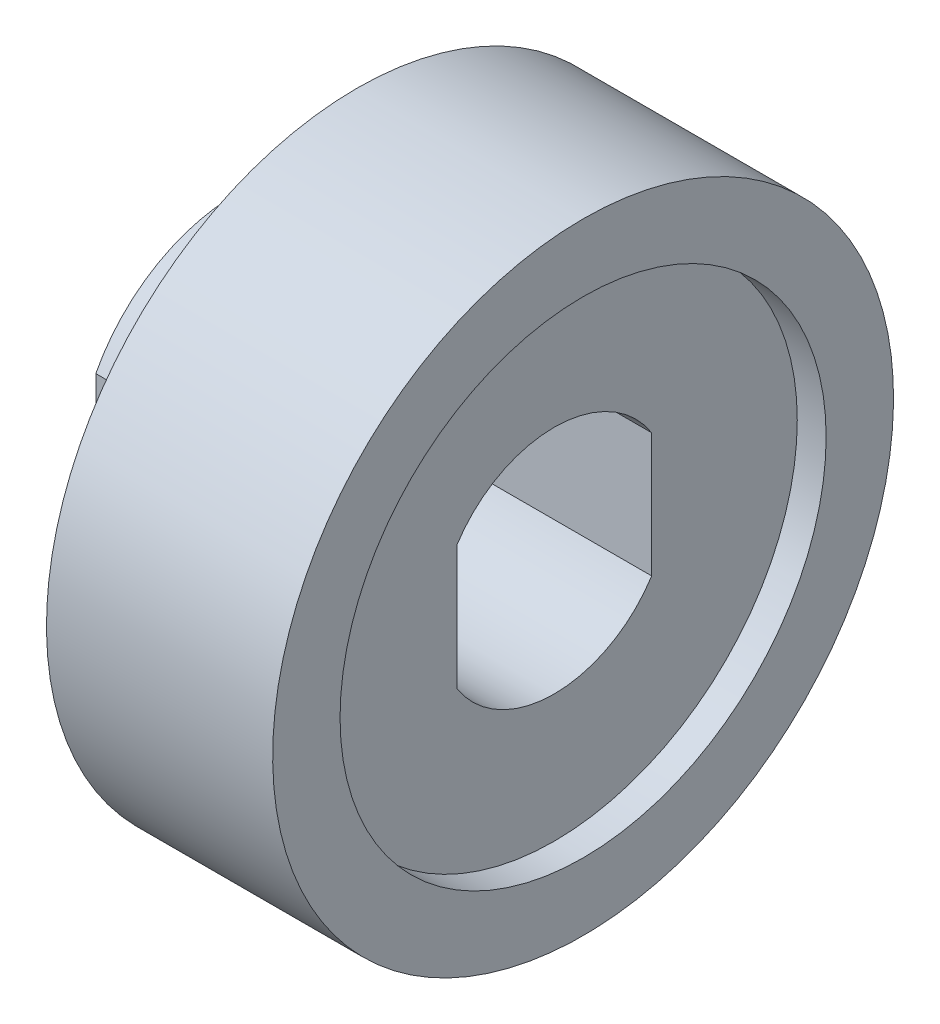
ISO-10303-21;
HEADER;
FILE_DESCRIPTION(('STEP AP214'),'2;1');
FILE_NAME('part.step','',(''),(''),'','','');
FILE_SCHEMA(('AUTOMOTIVE_DESIGN { 1 0 10303 214 1 1 1 1 }'));
ENDSEC;
DATA;
#1=APPLICATION_CONTEXT('core data for automotive mechanical design processes');
#2=APPLICATION_PROTOCOL_DEFINITION('international standard','automotive_design',2000,#1);
#3=PRODUCT_CONTEXT('',#1,'mechanical');
#4=PRODUCT('Part','Part','',(#3));
#5=PRODUCT_RELATED_PRODUCT_CATEGORY('part','',(#4));
#6=PRODUCT_DEFINITION_FORMATION('','',#4);
#7=PRODUCT_DEFINITION_CONTEXT('part definition',#1,'design');
#8=PRODUCT_DEFINITION('design','',#6,#7);
#9=PRODUCT_DEFINITION_SHAPE('','',#8);
#10=(LENGTH_UNIT() NAMED_UNIT(*) SI_UNIT(.MILLI.,.METRE.));
#11=(NAMED_UNIT(*) PLANE_ANGLE_UNIT() SI_UNIT($,.RADIAN.));
#12=(NAMED_UNIT(*) SI_UNIT($,.STERADIAN.) SOLID_ANGLE_UNIT());
#13=UNCERTAINTY_MEASURE_WITH_UNIT(LENGTH_MEASURE(1.E-05),#10,'distance_accuracy_value','');
#14=(GEOMETRIC_REPRESENTATION_CONTEXT(3) GLOBAL_UNCERTAINTY_ASSIGNED_CONTEXT((#13)) GLOBAL_UNIT_ASSIGNED_CONTEXT((#10,
#11,#12)) REPRESENTATION_CONTEXT('',''));
#15=CARTESIAN_POINT('',(0.,0.,0.));
#16=DIRECTION('',(0.,0.,1.));
#17=DIRECTION('',(1.,0.,0.));
#18=AXIS2_PLACEMENT_3D('',#15,#16,#17);
#19=CARTESIAN_POINT('',(0.,0.,0.));
#20=DIRECTION('',(-1.,0.,0.));
#21=DIRECTION('',(0.,0.,1.));
#22=AXIS2_PLACEMENT_3D('',#19,#20,#21);
#23=PLANE('',#22);
#24=DIRECTION('',(0.,1.,0.));
#25=VECTOR('',#24,1.);
#26=CARTESIAN_POINT('',(0.,1.28816730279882,-2.025));
#27=LINE('',#26,#25);
#28=CARTESIAN_POINT('',(0.,-1.28816730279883,-2.025));
#29=VERTEX_POINT('',#28);
#30=CARTESIAN_POINT('',(0.,1.28816730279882,-2.025));
#31=VERTEX_POINT('',#30);
#32=EDGE_CURVE('E169',#29,#31,#27,.T.);
#33=ORIENTED_EDGE('',*,*,#32,.F.);
#34=CARTESIAN_POINT('',(0.,0.,0.));
#35=DIRECTION('',(1.,0.,0.));
#36=DIRECTION('',(0.,-0.536736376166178,-0.84375));
#37=AXIS2_PLACEMENT_3D('',#34,#35,#36);
#38=CIRCLE('',#37,2.4);
#39=CARTESIAN_POINT('',(0.,-1.28816730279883,2.025));
#40=VERTEX_POINT('',#39);
#41=EDGE_CURVE('E162',#40,#29,#38,.T.);
#42=ORIENTED_EDGE('',*,*,#41,.F.);
#43=DIRECTION('',(0.,-1.,0.));
#44=VECTOR('',#43,1.);
#45=CARTESIAN_POINT('',(0.,1.28816730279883,2.025));
#46=LINE('',#45,#44);
#47=CARTESIAN_POINT('',(0.,1.28816730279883,2.025));
#48=VERTEX_POINT('',#47);
#49=EDGE_CURVE('E146',#48,#40,#46,.T.);
#50=ORIENTED_EDGE('',*,*,#49,.F.);
#51=CARTESIAN_POINT('',(0.,0.,0.));
#52=DIRECTION('',(1.,0.,0.));
#53=DIRECTION('',(0.,0.536736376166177,0.84375));
#54=AXIS2_PLACEMENT_3D('',#51,#52,#53);
#55=CIRCLE('',#54,2.4);
#56=EDGE_CURVE('E198',#31,#48,#55,.T.);
#57=ORIENTED_EDGE('',*,*,#56,.F.);
#58=EDGE_LOOP('',(#33,#42,#50,#57));
#59=FACE_BOUND('',#58,.T.);
#60=CARTESIAN_POINT('',(0.,0.,0.));
#61=DIRECTION('',(1.,0.,0.));
#62=DIRECTION('',(0.,-1.,0.));
#63=AXIS2_PLACEMENT_3D('',#60,#61,#62);
#64=CIRCLE('',#63,5.05);
#65=CARTESIAN_POINT('',(0.,5.05,0.));
#66=VERTEX_POINT('',#65);
#67=EDGE_CURVE('E180',#66,#66,#64,.T.);
#68=ORIENTED_EDGE('',*,*,#67,.T.);
#69=EDGE_LOOP('',(#68));
#70=FACE_BOUND('',#69,.T.);
#71=ADVANCED_FACE('F16',(#59,#70),#23,.F.);
#72=CARTESIAN_POINT('',(-4.1,0.,0.));
#73=DIRECTION('',(-1.,0.,0.));
#74=DIRECTION('',(0.,0.,1.));
#75=AXIS2_PLACEMENT_3D('',#72,#73,#74);
#76=PLANE('',#75);
#77=DIRECTION('',(0.,-1.,0.));
#78=VECTOR('',#77,1.);
#79=CARTESIAN_POINT('',(-4.1,-0.763933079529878,2.925));
#80=LINE('',#79,#78);
#81=CARTESIAN_POINT('',(-4.1,1.52786615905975,2.925));
#82=VERTEX_POINT('',#81);
#83=CARTESIAN_POINT('',(-4.1,-1.52786615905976,2.925));
#84=VERTEX_POINT('',#83);
#85=EDGE_CURVE('E209',#82,#84,#80,.T.);
#86=ORIENTED_EDGE('',*,*,#85,.T.);
#87=CARTESIAN_POINT('',(-4.1,0.,0.));
#88=DIRECTION('',(1.,0.,0.));
#89=DIRECTION('',(0.,-0.462989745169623,-0.886363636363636));
#90=AXIS2_PLACEMENT_3D('',#87,#88,#89);
#91=CIRCLE('',#90,3.3);
#92=CARTESIAN_POINT('',(-4.1,-1.52786615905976,-2.925));
#93=VERTEX_POINT('',#92);
#94=EDGE_CURVE('E323',#84,#93,#91,.T.);
#95=ORIENTED_EDGE('',*,*,#94,.T.);
#96=DIRECTION('',(0.,1.,0.));
#97=VECTOR('',#96,1.);
#98=CARTESIAN_POINT('',(-4.1,0.763933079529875,-2.925));
#99=LINE('',#98,#97);
#100=CARTESIAN_POINT('',(-4.1,1.52786615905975,-2.925));
#101=VERTEX_POINT('',#100);
#102=EDGE_CURVE('E320',#93,#101,#99,.T.);
#103=ORIENTED_EDGE('',*,*,#102,.T.);
#104=CARTESIAN_POINT('',(-4.1,0.,0.));
#105=DIRECTION('',(1.,0.,0.));
#106=DIRECTION('',(0.,0.462989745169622,0.886363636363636));
#107=AXIS2_PLACEMENT_3D('',#104,#105,#106);
#108=CIRCLE('',#107,3.3);
#109=EDGE_CURVE('E186',#101,#82,#108,.T.);
#110=ORIENTED_EDGE('',*,*,#109,.T.);
#111=EDGE_LOOP('',(#86,#95,#103,#110));
#112=FACE_BOUND('',#111,.T.);
#113=CARTESIAN_POINT('',(-4.1,0.,0.));
#114=DIRECTION('',(-1.,0.,0.));
#115=DIRECTION('',(0.,-1.,0.));
#116=AXIS2_PLACEMENT_3D('',#113,#114,#115);
#117=CIRCLE('',#116,6.45);
#118=CARTESIAN_POINT('',(-4.1,6.45,0.));
#119=VERTEX_POINT('',#118);
#120=EDGE_CURVE('E27',#119,#119,#117,.T.);
#121=ORIENTED_EDGE('',*,*,#120,.T.);
#122=EDGE_LOOP('',(#121));
#123=FACE_BOUND('',#122,.T.);
#124=ADVANCED_FACE('F476',(#112,#123),#76,.T.);
#125=CARTESIAN_POINT('',(0.,0.,0.));
#126=DIRECTION('',(-1.,0.,0.));
#127=DIRECTION('',(0.,-1.,0.));
#128=AXIS2_PLACEMENT_3D('',#125,#126,#127);
#129=CYLINDRICAL_SURFACE('',#128,6.45);
#130=ORIENTED_EDGE('',*,*,#120,.F.);
#131=DIRECTION('',(1.,0.,0.));
#132=VECTOR('',#131,1.);
#133=CARTESIAN_POINT('',(0.,6.45,0.));
#134=LINE('',#133,#132);
#135=CARTESIAN_POINT('',(0.6,6.45,0.));
#136=VERTEX_POINT('',#135);
#137=EDGE_CURVE('E11',#119,#136,#134,.T.);
#138=ORIENTED_EDGE('',*,*,#137,.T.);
#139=CARTESIAN_POINT('',(0.6,0.,0.));
#140=DIRECTION('',(1.,0.,0.));
#141=DIRECTION('',(0.,-1.,0.));
#142=AXIS2_PLACEMENT_3D('',#139,#140,#141);
#143=CIRCLE('',#142,6.45);
#144=EDGE_CURVE('E172',#136,#136,#143,.T.);
#145=ORIENTED_EDGE('',*,*,#144,.F.);
#146=ORIENTED_EDGE('',*,*,#137,.F.);
#147=EDGE_LOOP('',(#130,#138,#145,#146));
#148=FACE_BOUND('',#147,.T.);
#149=ADVANCED_FACE('F481',(#148),#129,.T.);
#150=CARTESIAN_POINT('',(0.,-1.28816730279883,-2.025));
#151=DIRECTION('',(0.,0.,1.));
#152=DIRECTION('',(0.,-1.,0.));
#153=AXIS2_PLACEMENT_3D('',#150,#151,#152);
#154=PLANE('',#153);
#155=ORIENTED_EDGE('',*,*,#32,.T.);
#156=DIRECTION('',(-1.,0.,0.));
#157=VECTOR('',#156,1.);
#158=CARTESIAN_POINT('',(0.,1.28816730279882,-2.025));
#159=LINE('',#158,#157);
#160=CARTESIAN_POINT('',(-4.1,1.28816730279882,-2.025));
#161=VERTEX_POINT('',#160);
#162=EDGE_CURVE('E196',#31,#161,#159,.T.);
#163=ORIENTED_EDGE('',*,*,#162,.T.);
#164=DIRECTION('',(0.,1.,0.));
#165=VECTOR('',#164,1.);
#166=CARTESIAN_POINT('',(-4.1,1.28816730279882,-2.025));
#167=LINE('',#166,#165);
#168=CARTESIAN_POINT('',(-4.1,-1.28816730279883,-2.025));
#169=VERTEX_POINT('',#168);
#170=EDGE_CURVE('E247',#169,#161,#167,.T.);
#171=ORIENTED_EDGE('',*,*,#170,.F.);
#172=DIRECTION('',(-1.,0.,0.));
#173=VECTOR('',#172,1.);
#174=CARTESIAN_POINT('',(0.,-1.28816730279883,-2.025));
#175=LINE('',#174,#173);
#176=EDGE_CURVE('E166',#29,#169,#175,.T.);
#177=ORIENTED_EDGE('',*,*,#176,.F.);
#178=EDGE_LOOP('',(#155,#163,#171,#177));
#179=FACE_BOUND('',#178,.T.);
#180=ADVANCED_FACE('F18',(#179),#154,.T.);
#181=CARTESIAN_POINT('',(0.,0.,0.));
#182=DIRECTION('',(-1.,0.,0.));
#183=DIRECTION('',(0.,0.536736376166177,0.84375));
#184=AXIS2_PLACEMENT_3D('',#181,#182,#183);
#185=CYLINDRICAL_SURFACE('',#184,2.4);
#186=ORIENTED_EDGE('',*,*,#56,.T.);
#187=DIRECTION('',(-1.,0.,0.));
#188=VECTOR('',#187,1.);
#189=CARTESIAN_POINT('',(0.,1.28816730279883,2.025));
#190=LINE('',#189,#188);
#191=CARTESIAN_POINT('',(-4.1,1.28816730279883,2.025));
#192=VERTEX_POINT('',#191);
#193=EDGE_CURVE('E152',#48,#192,#190,.T.);
#194=ORIENTED_EDGE('',*,*,#193,.T.);
#195=CARTESIAN_POINT('',(-4.1,0.,0.));
#196=DIRECTION('',(1.,0.,0.));
#197=DIRECTION('',(0.,0.536736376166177,0.84375));
#198=AXIS2_PLACEMENT_3D('',#195,#196,#197);
#199=CIRCLE('',#198,2.4);
#200=EDGE_CURVE('E250',#161,#192,#199,.T.);
#201=ORIENTED_EDGE('',*,*,#200,.F.);
#202=ORIENTED_EDGE('',*,*,#162,.F.);
#203=EDGE_LOOP('',(#186,#194,#201,#202));
#204=FACE_BOUND('',#203,.T.);
#205=ADVANCED_FACE('F334',(#204),#185,.F.);
#206=CARTESIAN_POINT('',(0.,1.28816730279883,2.025));
#207=DIRECTION('',(0.,0.,-1.));
#208=DIRECTION('',(0.,-1.,0.));
#209=AXIS2_PLACEMENT_3D('',#206,#207,#208);
#210=PLANE('',#209);
#211=ORIENTED_EDGE('',*,*,#49,.T.);
#212=DIRECTION('',(-1.,0.,0.));
#213=VECTOR('',#212,1.);
#214=CARTESIAN_POINT('',(0.,-1.28816730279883,2.025));
#215=LINE('',#214,#213);
#216=CARTESIAN_POINT('',(-4.1,-1.28816730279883,2.025));
#217=VERTEX_POINT('',#216);
#218=EDGE_CURVE('E150',#40,#217,#215,.T.);
#219=ORIENTED_EDGE('',*,*,#218,.T.);
#220=DIRECTION('',(0.,-1.,0.));
#221=VECTOR('',#220,1.);
#222=CARTESIAN_POINT('',(-4.1,1.28816730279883,2.025));
#223=LINE('',#222,#221);
#224=EDGE_CURVE('E204',#192,#217,#223,.T.);
#225=ORIENTED_EDGE('',*,*,#224,.F.);
#226=ORIENTED_EDGE('',*,*,#193,.F.);
#227=EDGE_LOOP('',(#211,#219,#225,#226));
#228=FACE_BOUND('',#227,.T.);
#229=ADVANCED_FACE('F148',(#228),#210,.T.);
#230=CARTESIAN_POINT('',(0.,0.,0.));
#231=DIRECTION('',(-1.,0.,0.));
#232=DIRECTION('',(0.,-0.536736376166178,-0.84375));
#233=AXIS2_PLACEMENT_3D('',#230,#231,#232);
#234=CYLINDRICAL_SURFACE('',#233,2.4);
#235=ORIENTED_EDGE('',*,*,#41,.T.);
#236=ORIENTED_EDGE('',*,*,#176,.T.);
#237=CARTESIAN_POINT('',(-4.1,0.,0.));
#238=DIRECTION('',(1.,0.,0.));
#239=DIRECTION('',(0.,-0.536736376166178,-0.84375));
#240=AXIS2_PLACEMENT_3D('',#237,#238,#239);
#241=CIRCLE('',#240,2.4);
#242=EDGE_CURVE('E164',#217,#169,#241,.T.);
#243=ORIENTED_EDGE('',*,*,#242,.F.);
#244=ORIENTED_EDGE('',*,*,#218,.F.);
#245=EDGE_LOOP('',(#235,#236,#243,#244));
#246=FACE_BOUND('',#245,.T.);
#247=ADVANCED_FACE('F161',(#246),#234,.F.);
#248=CARTESIAN_POINT('',(0.6,0.,0.));
#249=DIRECTION('',(-1.,0.,0.));
#250=DIRECTION('',(0.,0.,1.));
#251=AXIS2_PLACEMENT_3D('',#248,#249,#250);
#252=PLANE('',#251);
#253=CARTESIAN_POINT('',(0.6,0.,0.));
#254=DIRECTION('',(-1.,0.,0.));
#255=DIRECTION('',(0.,-1.,0.));
#256=AXIS2_PLACEMENT_3D('',#253,#254,#255);
#257=CIRCLE('',#256,5.05);
#258=CARTESIAN_POINT('',(0.6,5.05,0.));
#259=VERTEX_POINT('',#258);
#260=EDGE_CURVE('E311',#259,#259,#257,.T.);
#261=ORIENTED_EDGE('',*,*,#260,.T.);
#262=EDGE_LOOP('',(#261));
#263=FACE_BOUND('',#262,.T.);
#264=ORIENTED_EDGE('',*,*,#144,.T.);
#265=EDGE_LOOP('',(#264));
#266=FACE_BOUND('',#265,.T.);
#267=ADVANCED_FACE('F507',(#263,#266),#252,.F.);
#268=CARTESIAN_POINT('',(0.,0.,0.));
#269=DIRECTION('',(1.,0.,0.));
#270=DIRECTION('',(0.,-1.,0.));
#271=AXIS2_PLACEMENT_3D('',#268,#269,#270);
#272=CYLINDRICAL_SURFACE('',#271,5.05);
#273=ORIENTED_EDGE('',*,*,#260,.F.);
#274=DIRECTION('',(-1.,0.,0.));
#275=VECTOR('',#274,1.);
#276=CARTESIAN_POINT('',(0.,5.05,0.));
#277=LINE('',#276,#275);
#278=EDGE_CURVE('E239',#259,#66,#277,.T.);
#279=ORIENTED_EDGE('',*,*,#278,.T.);
#280=ORIENTED_EDGE('',*,*,#67,.F.);
#281=ORIENTED_EDGE('',*,*,#278,.F.);
#282=EDGE_LOOP('',(#273,#279,#280,#281));
#283=FACE_BOUND('',#282,.T.);
#284=ADVANCED_FACE('F485',(#283),#272,.F.);
#285=CARTESIAN_POINT('',(-6.6,0.,0.));
#286=DIRECTION('',(-1.,0.,0.));
#287=DIRECTION('',(0.,0.,1.));
#288=AXIS2_PLACEMENT_3D('',#285,#286,#287);
#289=PLANE('',#288);
#290=CARTESIAN_POINT('',(-6.6,0.,0.));
#291=DIRECTION('',(1.,0.,0.));
#292=DIRECTION('',(0.,0.547269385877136,0.83695652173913));
#293=AXIS2_PLACEMENT_3D('',#290,#291,#292);
#294=CIRCLE('',#293,2.3);
#295=CARTESIAN_POINT('',(-6.6,1.25871958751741,-1.925));
#296=VERTEX_POINT('',#295);
#297=CARTESIAN_POINT('',(-6.6,1.25871958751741,1.925));
#298=VERTEX_POINT('',#297);
#299=EDGE_CURVE('E222',#296,#298,#294,.T.);
#300=ORIENTED_EDGE('',*,*,#299,.T.);
#301=DIRECTION('',(0.,-1.,0.));
#302=VECTOR('',#301,1.);
#303=CARTESIAN_POINT('',(-6.6,1.25871958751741,1.925));
#304=LINE('',#303,#302);
#305=CARTESIAN_POINT('',(-6.6,-1.25871958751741,1.925));
#306=VERTEX_POINT('',#305);
#307=EDGE_CURVE('E251',#298,#306,#304,.T.);
#308=ORIENTED_EDGE('',*,*,#307,.T.);
#309=CARTESIAN_POINT('',(-6.6,0.,0.));
#310=DIRECTION('',(1.,0.,0.));
#311=DIRECTION('',(0.,-0.547269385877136,-0.83695652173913));
#312=AXIS2_PLACEMENT_3D('',#309,#310,#311);
#313=CIRCLE('',#312,2.3);
#314=CARTESIAN_POINT('',(-6.6,-1.25871958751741,-1.925));
#315=VERTEX_POINT('',#314);
#316=EDGE_CURVE('E264',#306,#315,#313,.T.);
#317=ORIENTED_EDGE('',*,*,#316,.T.);
#318=DIRECTION('',(0.,1.,0.));
#319=VECTOR('',#318,1.);
#320=CARTESIAN_POINT('',(-6.6,1.25871958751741,-1.925));
#321=LINE('',#320,#319);
#322=EDGE_CURVE('E304',#315,#296,#321,.T.);
#323=ORIENTED_EDGE('',*,*,#322,.T.);
#324=EDGE_LOOP('',(#300,#308,#317,#323));
#325=FACE_BOUND('',#324,.T.);
#326=CARTESIAN_POINT('',(-6.6,0.,0.));
#327=DIRECTION('',(-1.,0.,0.));
#328=DIRECTION('',(0.,0.462989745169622,0.886363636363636));
#329=AXIS2_PLACEMENT_3D('',#326,#327,#328);
#330=CIRCLE('',#329,3.3);
#331=CARTESIAN_POINT('',(-6.6,1.52786615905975,2.925));
#332=VERTEX_POINT('',#331);
#333=CARTESIAN_POINT('',(-6.6,1.52786615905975,-2.925));
#334=VERTEX_POINT('',#333);
#335=EDGE_CURVE('E184',#332,#334,#330,.T.);
#336=ORIENTED_EDGE('',*,*,#335,.T.);
#337=DIRECTION('',(0.,-1.,0.));
#338=VECTOR('',#337,1.);
#339=CARTESIAN_POINT('',(-6.6,1.52786615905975,-2.925));
#340=LINE('',#339,#338);
#341=CARTESIAN_POINT('',(-6.6,-1.52786615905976,-2.925));
#342=VERTEX_POINT('',#341);
#343=EDGE_CURVE('E193',#334,#342,#340,.T.);
#344=ORIENTED_EDGE('',*,*,#343,.T.);
#345=CARTESIAN_POINT('',(-6.6,0.,0.));
#346=DIRECTION('',(-1.,0.,0.));
#347=DIRECTION('',(0.,-0.462989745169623,-0.886363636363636));
#348=AXIS2_PLACEMENT_3D('',#345,#346,#347);
#349=CIRCLE('',#348,3.3);
#350=CARTESIAN_POINT('',(-6.6,-1.52786615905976,2.925));
#351=VERTEX_POINT('',#350);
#352=EDGE_CURVE('E321',#342,#351,#349,.T.);
#353=ORIENTED_EDGE('',*,*,#352,.T.);
#354=DIRECTION('',(0.,1.,0.));
#355=VECTOR('',#354,1.);
#356=CARTESIAN_POINT('',(-6.6,1.52786615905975,2.925));
#357=LINE('',#356,#355);
#358=EDGE_CURVE('E208',#351,#332,#357,.T.);
#359=ORIENTED_EDGE('',*,*,#358,.T.);
#360=EDGE_LOOP('',(#336,#344,#353,#359));
#361=FACE_BOUND('',#360,.T.);
#362=ADVANCED_FACE('F450',(#325,#361),#289,.T.);
#363=CARTESIAN_POINT('',(-4.1,0.,0.));
#364=DIRECTION('',(-1.,0.,0.));
#365=DIRECTION('',(0.,0.462989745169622,0.886363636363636));
#366=AXIS2_PLACEMENT_3D('',#363,#364,#365);
#367=CYLINDRICAL_SURFACE('',#366,3.3);
#368=ORIENTED_EDGE('',*,*,#109,.F.);
#369=DIRECTION('',(-1.,0.,0.));
#370=VECTOR('',#369,1.);
#371=CARTESIAN_POINT('',(-4.1,1.52786615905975,-2.925));
#372=LINE('',#371,#370);
#373=EDGE_CURVE('E189',#101,#334,#372,.T.);
#374=ORIENTED_EDGE('',*,*,#373,.T.);
#375=ORIENTED_EDGE('',*,*,#335,.F.);
#376=DIRECTION('',(-1.,0.,0.));
#377=VECTOR('',#376,1.);
#378=CARTESIAN_POINT('',(-4.1,1.52786615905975,2.925));
#379=LINE('',#378,#377);
#380=EDGE_CURVE('E205',#82,#332,#379,.T.);
#381=ORIENTED_EDGE('',*,*,#380,.F.);
#382=EDGE_LOOP('',(#368,#374,#375,#381));
#383=FACE_BOUND('',#382,.T.);
#384=ADVANCED_FACE('F454',(#383),#367,.T.);
#385=CARTESIAN_POINT('',(-4.1,1.52786615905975,-2.925));
#386=DIRECTION('',(0.,0.,-1.));
#387=DIRECTION('',(0.,-1.,0.));
#388=AXIS2_PLACEMENT_3D('',#385,#386,#387);
#389=PLANE('',#388);
#390=ORIENTED_EDGE('',*,*,#102,.F.);
#391=DIRECTION('',(-1.,0.,0.));
#392=VECTOR('',#391,1.);
#393=CARTESIAN_POINT('',(-4.1,-1.52786615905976,-2.925));
#394=LINE('',#393,#392);
#395=EDGE_CURVE('E20',#93,#342,#394,.T.);
#396=ORIENTED_EDGE('',*,*,#395,.T.);
#397=ORIENTED_EDGE('',*,*,#343,.F.);
#398=ORIENTED_EDGE('',*,*,#373,.F.);
#399=EDGE_LOOP('',(#390,#396,#397,#398));
#400=FACE_BOUND('',#399,.T.);
#401=ADVANCED_FACE('F456',(#400),#389,.T.);
#402=CARTESIAN_POINT('',(-4.1,0.,0.));
#403=DIRECTION('',(-1.,0.,0.));
#404=DIRECTION('',(0.,-0.462989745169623,-0.886363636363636));
#405=AXIS2_PLACEMENT_3D('',#402,#403,#404);
#406=CYLINDRICAL_SURFACE('',#405,3.3);
#407=ORIENTED_EDGE('',*,*,#94,.F.);
#408=DIRECTION('',(-1.,0.,0.));
#409=VECTOR('',#408,1.);
#410=CARTESIAN_POINT('',(-4.1,-1.52786615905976,2.925));
#411=LINE('',#410,#409);
#412=EDGE_CURVE('E219',#84,#351,#411,.T.);
#413=ORIENTED_EDGE('',*,*,#412,.T.);
#414=ORIENTED_EDGE('',*,*,#352,.F.);
#415=ORIENTED_EDGE('',*,*,#395,.F.);
#416=EDGE_LOOP('',(#407,#413,#414,#415));
#417=FACE_BOUND('',#416,.T.);
#418=ADVANCED_FACE('F460',(#417),#406,.T.);
#419=CARTESIAN_POINT('',(-4.1,-1.52786615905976,2.925));
#420=DIRECTION('',(0.,0.,1.));
#421=DIRECTION('',(0.,-1.,0.));
#422=AXIS2_PLACEMENT_3D('',#419,#420,#421);
#423=PLANE('',#422);
#424=ORIENTED_EDGE('',*,*,#85,.F.);
#425=ORIENTED_EDGE('',*,*,#380,.T.);
#426=ORIENTED_EDGE('',*,*,#358,.F.);
#427=ORIENTED_EDGE('',*,*,#412,.F.);
#428=EDGE_LOOP('',(#424,#425,#426,#427));
#429=FACE_BOUND('',#428,.T.);
#430=ADVANCED_FACE('F462',(#429),#423,.T.);
#431=CARTESIAN_POINT('',(-4.1,0.,0.));
#432=DIRECTION('',(-1.,0.,0.));
#433=DIRECTION('',(0.,0.547269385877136,0.83695652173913));
#434=AXIS2_PLACEMENT_3D('',#431,#432,#433);
#435=CYLINDRICAL_SURFACE('',#434,2.3);
#436=CARTESIAN_POINT('',(-4.1,0.,0.));
#437=DIRECTION('',(1.,0.,0.));
#438=DIRECTION('',(0.,0.547269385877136,0.83695652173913));
#439=AXIS2_PLACEMENT_3D('',#436,#437,#438);
#440=CIRCLE('',#439,2.3);
#441=CARTESIAN_POINT('',(-4.1,1.25871958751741,-1.925));
#442=VERTEX_POINT('',#441);
#443=CARTESIAN_POINT('',(-4.1,1.25871958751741,1.925));
#444=VERTEX_POINT('',#443);
#445=EDGE_CURVE('E200',#442,#444,#440,.T.);
#446=ORIENTED_EDGE('',*,*,#445,.T.);
#447=DIRECTION('',(-1.,0.,0.));
#448=VECTOR('',#447,1.);
#449=CARTESIAN_POINT('',(-4.1,1.25871958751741,1.925));
#450=LINE('',#449,#448);
#451=EDGE_CURVE('E229',#444,#298,#450,.T.);
#452=ORIENTED_EDGE('',*,*,#451,.T.);
#453=ORIENTED_EDGE('',*,*,#299,.F.);
#454=DIRECTION('',(-1.,0.,0.));
#455=VECTOR('',#454,1.);
#456=CARTESIAN_POINT('',(-4.1,1.25871958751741,-1.925));
#457=LINE('',#456,#455);
#458=EDGE_CURVE('E244',#442,#296,#457,.T.);
#459=ORIENTED_EDGE('',*,*,#458,.F.);
#460=EDGE_LOOP('',(#446,#452,#453,#459));
#461=FACE_BOUND('',#460,.T.);
#462=ADVANCED_FACE('F301',(#461),#435,.F.);
#463=CARTESIAN_POINT('',(-4.1,1.25871958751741,1.925));
#464=DIRECTION('',(0.,0.,-1.));
#465=DIRECTION('',(-1.,0.,0.));
#466=AXIS2_PLACEMENT_3D('',#463,#464,#465);
#467=PLANE('',#466);
#468=DIRECTION('',(0.,-1.,0.));
#469=VECTOR('',#468,1.);
#470=CARTESIAN_POINT('',(-4.1,1.25871958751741,1.925));
#471=LINE('',#470,#469);
#472=CARTESIAN_POINT('',(-4.1,-1.25871958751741,1.925));
#473=VERTEX_POINT('',#472);
#474=EDGE_CURVE('E240',#444,#473,#471,.T.);
#475=ORIENTED_EDGE('',*,*,#474,.T.);
#476=DIRECTION('',(-1.,0.,0.));
#477=VECTOR('',#476,1.);
#478=CARTESIAN_POINT('',(-4.1,-1.25871958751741,1.925));
#479=LINE('',#478,#477);
#480=EDGE_CURVE('E254',#473,#306,#479,.T.);
#481=ORIENTED_EDGE('',*,*,#480,.T.);
#482=ORIENTED_EDGE('',*,*,#307,.F.);
#483=ORIENTED_EDGE('',*,*,#451,.F.);
#484=EDGE_LOOP('',(#475,#481,#482,#483));
#485=FACE_BOUND('',#484,.T.);
#486=ADVANCED_FACE('F470',(#485),#467,.T.);
#487=CARTESIAN_POINT('',(-4.1,0.,0.));
#488=DIRECTION('',(-1.,0.,0.));
#489=DIRECTION('',(0.,-0.547269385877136,-0.83695652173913));
#490=AXIS2_PLACEMENT_3D('',#487,#488,#489);
#491=CYLINDRICAL_SURFACE('',#490,2.3);
#492=CARTESIAN_POINT('',(-4.1,0.,0.));
#493=DIRECTION('',(1.,0.,0.));
#494=DIRECTION('',(0.,-0.547269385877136,-0.83695652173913));
#495=AXIS2_PLACEMENT_3D('',#492,#493,#494);
#496=CIRCLE('',#495,2.3);
#497=CARTESIAN_POINT('',(-4.1,-1.25871958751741,-1.925));
#498=VERTEX_POINT('',#497);
#499=EDGE_CURVE('E232',#473,#498,#496,.T.);
#500=ORIENTED_EDGE('',*,*,#499,.T.);
#501=DIRECTION('',(-1.,0.,0.));
#502=VECTOR('',#501,1.);
#503=CARTESIAN_POINT('',(-4.1,-1.25871958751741,-1.925));
#504=LINE('',#503,#502);
#505=EDGE_CURVE('E271',#498,#315,#504,.T.);
#506=ORIENTED_EDGE('',*,*,#505,.T.);
#507=ORIENTED_EDGE('',*,*,#316,.F.);
#508=ORIENTED_EDGE('',*,*,#480,.F.);
#509=EDGE_LOOP('',(#500,#506,#507,#508));
#510=FACE_BOUND('',#509,.T.);
#511=ADVANCED_FACE('F294',(#510),#491,.F.);
#512=CARTESIAN_POINT('',(-4.1,-1.25871958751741,-1.925));
#513=DIRECTION('',(0.,0.,1.));
#514=DIRECTION('',(0.,-1.,0.));
#515=AXIS2_PLACEMENT_3D('',#512,#513,#514);
#516=PLANE('',#515);
#517=DIRECTION('',(0.,1.,0.));
#518=VECTOR('',#517,1.);
#519=CARTESIAN_POINT('',(-4.1,1.25871958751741,-1.925));
#520=LINE('',#519,#518);
#521=EDGE_CURVE('E203',#498,#442,#520,.T.);
#522=ORIENTED_EDGE('',*,*,#521,.T.);
#523=ORIENTED_EDGE('',*,*,#458,.T.);
#524=ORIENTED_EDGE('',*,*,#322,.F.);
#525=ORIENTED_EDGE('',*,*,#505,.F.);
#526=EDGE_LOOP('',(#522,#523,#524,#525));
#527=FACE_BOUND('',#526,.T.);
#528=ADVANCED_FACE('F488',(#527),#516,.T.);
#529=CARTESIAN_POINT('',(-4.1,0.,0.));
#530=DIRECTION('',(-1.,0.,0.));
#531=DIRECTION('',(0.,0.,1.));
#532=AXIS2_PLACEMENT_3D('',#529,#530,#531);
#533=PLANE('',#532);
#534=ORIENTED_EDGE('',*,*,#445,.F.);
#535=ORIENTED_EDGE('',*,*,#521,.F.);
#536=ORIENTED_EDGE('',*,*,#499,.F.);
#537=ORIENTED_EDGE('',*,*,#474,.F.);
#538=EDGE_LOOP('',(#534,#535,#536,#537));
#539=FACE_BOUND('',#538,.T.);
#540=ORIENTED_EDGE('',*,*,#242,.T.);
#541=ORIENTED_EDGE('',*,*,#170,.T.);
#542=ORIENTED_EDGE('',*,*,#200,.T.);
#543=ORIENTED_EDGE('',*,*,#224,.T.);
#544=EDGE_LOOP('',(#540,#541,#542,#543));
#545=FACE_BOUND('',#544,.T.);
#546=ADVANCED_FACE('F298',(#539,#545),#533,.F.);
#547=CLOSED_SHELL('',(#71,#124,#149,#180,#205,#229,#247,#267,#284,#362,#384,#401,#418,#430,#462,
#486,#511,#528,#546));
#548=MANIFOLD_SOLID_BREP('B1',#547);
#549=ADVANCED_BREP_SHAPE_REPRESENTATION('',(#18,#548),#14);
#550=SHAPE_DEFINITION_REPRESENTATION(#9,#549);
ENDSEC;
END-ISO-10303-21;
